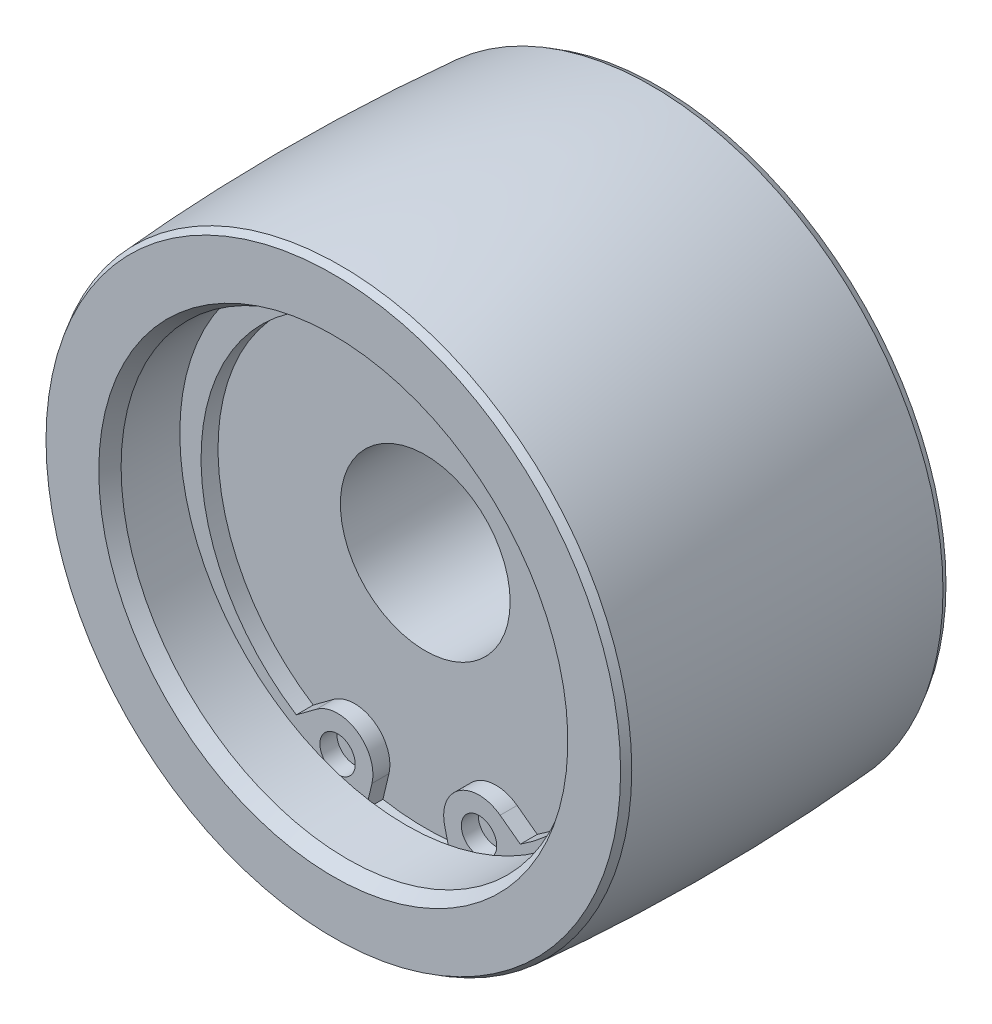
ISO-10303-21;
HEADER;
FILE_DESCRIPTION(('STEP AP214'),'2;1');
FILE_NAME('part.step','',(''),(''),'','','');
FILE_SCHEMA(('AUTOMOTIVE_DESIGN { 1 0 10303 214 1 1 1 1 }'));
ENDSEC;
DATA;
#1=APPLICATION_CONTEXT('core data for automotive mechanical design processes');
#2=APPLICATION_PROTOCOL_DEFINITION('international standard','automotive_design',2000,#1);
#3=PRODUCT_CONTEXT('',#1,'mechanical');
#4=PRODUCT('Part','Part','',(#3));
#5=PRODUCT_RELATED_PRODUCT_CATEGORY('part','',(#4));
#6=PRODUCT_DEFINITION_FORMATION('','',#4);
#7=PRODUCT_DEFINITION_CONTEXT('part definition',#1,'design');
#8=PRODUCT_DEFINITION('design','',#6,#7);
#9=PRODUCT_DEFINITION_SHAPE('','',#8);
#10=(LENGTH_UNIT() NAMED_UNIT(*) SI_UNIT(.MILLI.,.METRE.));
#11=(NAMED_UNIT(*) PLANE_ANGLE_UNIT() SI_UNIT($,.RADIAN.));
#12=(NAMED_UNIT(*) SI_UNIT($,.STERADIAN.) SOLID_ANGLE_UNIT());
#13=UNCERTAINTY_MEASURE_WITH_UNIT(LENGTH_MEASURE(1.E-05),#10,'distance_accuracy_value','');
#14=(GEOMETRIC_REPRESENTATION_CONTEXT(3) GLOBAL_UNCERTAINTY_ASSIGNED_CONTEXT((#13)) GLOBAL_UNIT_ASSIGNED_CONTEXT((#10,
#11,#12)) REPRESENTATION_CONTEXT('',''));
#15=CARTESIAN_POINT('',(0.,0.,0.));
#16=DIRECTION('',(0.,0.,1.));
#17=DIRECTION('',(1.,0.,0.));
#18=AXIS2_PLACEMENT_3D('',#15,#16,#17);
#19=CARTESIAN_POINT('',(0.,0.,0.));
#20=DIRECTION('',(0.,0.,-1.));
#21=DIRECTION('',(-1.,0.,0.));
#22=AXIS2_PLACEMENT_3D('',#19,#20,#21);
#23=DEGENERATE_TOROIDAL_SURFACE('',#22,129.,150.,.F.);
#24=CARTESIAN_POINT('',(0.,0.,-11.));
#25=DIRECTION('',(0.,0.,-1.));
#26=DIRECTION('',(-1.,0.,0.));
#27=AXIS2_PLACEMENT_3D('',#24,#25,#26);
#28=CIRCLE('',#27,20.5961229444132);
#29=CARTESIAN_POINT('',(-20.5961229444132,0.,-11.));
#30=VERTEX_POINT('',#29);
#31=EDGE_CURVE('E185',#30,#30,#28,.F.);
#32=ORIENTED_EDGE('',*,*,#31,.T.);
#33=EDGE_LOOP('',(#32));
#34=FACE_BOUND('',#33,.T.);
#35=CARTESIAN_POINT('',(0.,0.,11.));
#36=DIRECTION('',(0.,0.,1.));
#37=DIRECTION('',(1.,0.,0.));
#38=AXIS2_PLACEMENT_3D('',#35,#36,#37);
#39=CIRCLE('',#38,20.5961229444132);
#40=CARTESIAN_POINT('',(20.5961229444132,0.,11.));
#41=VERTEX_POINT('',#40);
#42=EDGE_CURVE('E171',#41,#41,#39,.F.);
#43=ORIENTED_EDGE('',*,*,#42,.T.);
#44=EDGE_LOOP('',(#43));
#45=FACE_BOUND('',#44,.T.);
#46=ADVANCED_FACE('F14',(#34,#45),#23,.F.);
#47=CARTESIAN_POINT('',(0.,0.,-10.5));
#48=DIRECTION('',(0.,0.,1.));
#49=DIRECTION('',(1.,0.,0.));
#50=AXIS2_PLACEMENT_3D('',#47,#48,#49);
#51=CONICAL_SURFACE('',#50,20.8847980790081,0.523598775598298);
#52=CARTESIAN_POINT('',(0.,0.,-11.5));
#53=DIRECTION('',(0.,0.,-1.));
#54=DIRECTION('',(-1.,0.,0.));
#55=AXIS2_PLACEMENT_3D('',#52,#53,#54);
#56=CIRCLE('',#55,20.3074478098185);
#57=CARTESIAN_POINT('',(-20.3074478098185,0.,-11.5));
#58=VERTEX_POINT('',#57);
#59=EDGE_CURVE('E186',#58,#58,#56,.T.);
#60=ORIENTED_EDGE('',*,*,#59,.F.);
#61=EDGE_LOOP('',(#60));
#62=FACE_BOUND('',#61,.T.);
#63=ORIENTED_EDGE('',*,*,#31,.F.);
#64=EDGE_LOOP('',(#63));
#65=FACE_BOUND('',#64,.T.);
#66=ADVANCED_FACE('F284',(#62,#65),#51,.T.);
#67=CARTESIAN_POINT('',(0.,0.,11.5));
#68=DIRECTION('',(0.,0.,-1.));
#69=DIRECTION('',(-1.,0.,0.));
#70=AXIS2_PLACEMENT_3D('',#67,#68,#69);
#71=CONICAL_SURFACE('',#70,20.3074478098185,0.523598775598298);
#72=CARTESIAN_POINT('',(0.,0.,11.5));
#73=DIRECTION('',(0.,0.,-1.));
#74=DIRECTION('',(-1.,0.,0.));
#75=AXIS2_PLACEMENT_3D('',#72,#73,#74);
#76=CIRCLE('',#75,20.3074478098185);
#77=CARTESIAN_POINT('',(-20.3074478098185,0.,11.5));
#78=VERTEX_POINT('',#77);
#79=EDGE_CURVE('E182',#78,#78,#76,.T.);
#80=ORIENTED_EDGE('',*,*,#79,.T.);
#81=EDGE_LOOP('',(#80));
#82=FACE_BOUND('',#81,.T.);
#83=ORIENTED_EDGE('',*,*,#42,.F.);
#84=EDGE_LOOP('',(#83));
#85=FACE_BOUND('',#84,.T.);
#86=ADVANCED_FACE('F287',(#82,#85),#71,.T.);
#87=CARTESIAN_POINT('',(0.,0.,-11.5));
#88=DIRECTION('',(0.,0.,1.));
#89=DIRECTION('',(1.,0.,0.));
#90=AXIS2_PLACEMENT_3D('',#87,#88,#89);
#91=PLANE('',#90);
#92=ORIENTED_EDGE('',*,*,#59,.T.);
#93=EDGE_LOOP('',(#92));
#94=FACE_BOUND('',#93,.T.);
#95=CARTESIAN_POINT('',(0.,0.,-11.5));
#96=DIRECTION('',(0.,0.,-1.));
#97=DIRECTION('',(-1.,0.,0.));
#98=AXIS2_PLACEMENT_3D('',#95,#96,#97);
#99=CIRCLE('',#98,13.);
#100=CARTESIAN_POINT('',(-13.,0.,-11.5));
#101=VERTEX_POINT('',#100);
#102=EDGE_CURVE('E155',#101,#101,#99,.T.);
#103=ORIENTED_EDGE('',*,*,#102,.F.);
#104=EDGE_LOOP('',(#103));
#105=FACE_BOUND('',#104,.T.);
#106=ADVANCED_FACE('F291',(#94,#105),#91,.F.);
#107=CARTESIAN_POINT('',(0.,0.,11.5));
#108=DIRECTION('',(0.,0.,1.));
#109=DIRECTION('',(1.,0.,0.));
#110=AXIS2_PLACEMENT_3D('',#107,#108,#109);
#111=PLANE('',#110);
#112=ORIENTED_EDGE('',*,*,#79,.F.);
#113=EDGE_LOOP('',(#112));
#114=FACE_BOUND('',#113,.T.);
#115=CARTESIAN_POINT('',(0.,0.,11.5));
#116=DIRECTION('',(0.,0.,-1.));
#117=DIRECTION('',(-1.,0.,0.));
#118=AXIS2_PLACEMENT_3D('',#115,#116,#117);
#119=CIRCLE('',#118,16.5773502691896);
#120=CARTESIAN_POINT('',(-16.5773502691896,0.,11.5));
#121=VERTEX_POINT('',#120);
#122=EDGE_CURVE('E179',#121,#121,#119,.T.);
#123=ORIENTED_EDGE('',*,*,#122,.T.);
#124=EDGE_LOOP('',(#123));
#125=FACE_BOUND('',#124,.T.);
#126=ADVANCED_FACE('F312',(#114,#125),#111,.T.);
#127=CARTESIAN_POINT('',(0.,0.,-12.65));
#128=DIRECTION('',(0.,0.,-1.));
#129=DIRECTION('',(-1.,0.,0.));
#130=AXIS2_PLACEMENT_3D('',#127,#128,#129);
#131=CYLINDRICAL_SURFACE('',#130,13.);
#132=CARTESIAN_POINT('',(0.,0.,-5.));
#133=DIRECTION('',(0.,0.,1.));
#134=DIRECTION('',(1.,0.,0.));
#135=AXIS2_PLACEMENT_3D('',#132,#133,#134);
#136=CIRCLE('',#135,13.);
#137=CARTESIAN_POINT('',(13.,0.,-5.));
#138=VERTEX_POINT('',#137);
#139=EDGE_CURVE('E195',#138,#138,#136,.T.);
#140=ORIENTED_EDGE('',*,*,#139,.T.);
#141=EDGE_LOOP('',(#140));
#142=FACE_BOUND('',#141,.T.);
#143=ORIENTED_EDGE('',*,*,#102,.T.);
#144=EDGE_LOOP('',(#143));
#145=FACE_BOUND('',#144,.T.);
#146=ADVANCED_FACE('F298',(#142,#145),#131,.F.);
#147=CARTESIAN_POINT('',(0.,0.,10.5));
#148=DIRECTION('',(0.,0.,1.));
#149=DIRECTION('',(1.,0.,0.));
#150=AXIS2_PLACEMENT_3D('',#147,#148,#149);
#151=CONICAL_SURFACE('',#150,16.,0.5235987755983);
#152=ORIENTED_EDGE('',*,*,#122,.F.);
#153=EDGE_LOOP('',(#152));
#154=FACE_BOUND('',#153,.T.);
#155=CARTESIAN_POINT('',(0.,0.,10.5));
#156=DIRECTION('',(0.,0.,-1.));
#157=DIRECTION('',(-1.,0.,0.));
#158=AXIS2_PLACEMENT_3D('',#155,#156,#157);
#159=CIRCLE('',#158,16.);
#160=CARTESIAN_POINT('',(-16.,0.,10.5));
#161=VERTEX_POINT('',#160);
#162=EDGE_CURVE('E176',#161,#161,#159,.T.);
#163=ORIENTED_EDGE('',*,*,#162,.T.);
#164=EDGE_LOOP('',(#163));
#165=FACE_BOUND('',#164,.T.);
#166=ADVANCED_FACE('F282',(#154,#165),#151,.F.);
#167=CARTESIAN_POINT('',(0.,6.,-5.));
#168=DIRECTION('',(0.,0.,1.));
#169=DIRECTION('',(1.,0.,0.));
#170=AXIS2_PLACEMENT_3D('',#167,#168,#169);
#171=PLANE('',#170);
#172=ORIENTED_EDGE('',*,*,#139,.F.);
#173=EDGE_LOOP('',(#172));
#174=FACE_BOUND('',#173,.T.);
#175=CARTESIAN_POINT('',(0.,0.,-5.));
#176=DIRECTION('',(0.,0.,1.));
#177=DIRECTION('',(1.,0.,0.));
#178=AXIS2_PLACEMENT_3D('',#175,#176,#177);
#179=CIRCLE('',#178,6.);
#180=CARTESIAN_POINT('',(6.,0.,-5.));
#181=VERTEX_POINT('',#180);
#182=EDGE_CURVE('E189',#181,#181,#179,.T.);
#183=ORIENTED_EDGE('',*,*,#182,.T.);
#184=EDGE_LOOP('',(#183));
#185=FACE_BOUND('',#184,.T.);
#186=ADVANCED_FACE('F279',(#174,#185),#171,.F.);
#187=CARTESIAN_POINT('',(0.,0.,-12.65));
#188=DIRECTION('',(0.,0.,-1.));
#189=DIRECTION('',(-1.,0.,0.));
#190=AXIS2_PLACEMENT_3D('',#187,#188,#189);
#191=CYLINDRICAL_SURFACE('',#190,16.);
#192=ORIENTED_EDGE('',*,*,#162,.F.);
#193=EDGE_LOOP('',(#192));
#194=FACE_BOUND('',#193,.T.);
#195=CARTESIAN_POINT('',(0.,0.,6.35));
#196=DIRECTION('',(0.,0.,-1.));
#197=DIRECTION('',(-1.,0.,0.));
#198=AXIS2_PLACEMENT_3D('',#195,#196,#197);
#199=CIRCLE('',#198,16.);
#200=CARTESIAN_POINT('',(-16.,0.,6.35));
#201=VERTEX_POINT('',#200);
#202=EDGE_CURVE('E168',#201,#201,#199,.T.);
#203=ORIENTED_EDGE('',*,*,#202,.T.);
#204=EDGE_LOOP('',(#203));
#205=FACE_BOUND('',#204,.T.);
#206=ADVANCED_FACE('F277',(#194,#205),#191,.F.);
#207=CARTESIAN_POINT('',(0.,0.,-45.));
#208=DIRECTION('',(0.,0.,1.));
#209=DIRECTION('',(1.,0.,0.));
#210=AXIS2_PLACEMENT_3D('',#207,#208,#209);
#211=CYLINDRICAL_SURFACE('',#210,6.);
#212=ORIENTED_EDGE('',*,*,#182,.F.);
#213=EDGE_LOOP('',(#212));
#214=FACE_BOUND('',#213,.T.);
#215=CARTESIAN_POINT('',(0.,0.,5.));
#216=DIRECTION('',(0.,0.,1.));
#217=DIRECTION('',(1.,0.,0.));
#218=AXIS2_PLACEMENT_3D('',#215,#216,#217);
#219=CIRCLE('',#218,6.);
#220=CARTESIAN_POINT('',(6.,0.,5.));
#221=VERTEX_POINT('',#220);
#222=EDGE_CURVE('E192',#221,#221,#219,.T.);
#223=ORIENTED_EDGE('',*,*,#222,.T.);
#224=EDGE_LOOP('',(#223));
#225=FACE_BOUND('',#224,.T.);
#226=ADVANCED_FACE('F272',(#214,#225),#211,.F.);
#227=CARTESIAN_POINT('',(0.,6.,5.));
#228=DIRECTION('',(0.,0.,-1.));
#229=DIRECTION('',(-1.,0.,0.));
#230=AXIS2_PLACEMENT_3D('',#227,#228,#229);
#231=PLANE('',#230);
#232=ORIENTED_EDGE('',*,*,#222,.F.);
#233=EDGE_LOOP('',(#232));
#234=FACE_BOUND('',#233,.T.);
#235=DIRECTION('',(0.231349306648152,-0.972870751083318,0.));
#236=VECTOR('',#235,1.);
#237=CARTESIAN_POINT('',(-2.25152493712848,5.46458588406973,5.));
#238=LINE('',#237,#236);
#239=CARTESIAN_POINT('',(2.56782312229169,-14.8017500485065,5.));
#240=VERTEX_POINT('',#239);
#241=CARTESIAN_POINT('',(2.99125499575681,-16.5823669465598,5.));
#242=VERTEX_POINT('',#241);
#243=EDGE_CURVE('E9',#240,#242,#238,.T.);
#244=ORIENTED_EDGE('',*,*,#243,.F.);
#245=CARTESIAN_POINT('',(5.,-14.2233767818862,5.));
#246=DIRECTION('',(0.,0.,-1.));
#247=DIRECTION('',(-1.,0.,0.));
#248=AXIS2_PLACEMENT_3D('',#245,#246,#247);
#249=CIRCLE('',#248,2.5);
#250=CARTESIAN_POINT('',(6.49138441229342,-12.2169439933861,5.));
#251=VERTEX_POINT('',#250);
#252=EDGE_CURVE('E25',#240,#251,#249,.T.);
#253=ORIENTED_EDGE('',*,*,#252,.T.);
#254=DIRECTION('',(-0.802573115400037,0.596553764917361,0.));
#255=VECTOR('',#254,1.);
#256=CARTESIAN_POINT('',(-6.41174177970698,-2.62603151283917,5.));
#257=LINE('',#256,#255);
#258=CARTESIAN_POINT('',(7.91695293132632,-13.2765711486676,5.));
#259=VERTEX_POINT('',#258);
#260=EDGE_CURVE('E73',#259,#251,#257,.T.);
#261=ORIENTED_EDGE('',*,*,#260,.F.);
#262=CARTESIAN_POINT('',(0.,-0.95,5.));
#263=DIRECTION('',(0.,0.,-1.));
#264=DIRECTION('',(-1.,0.,0.));
#265=AXIS2_PLACEMENT_3D('',#262,#263,#264);
#266=CIRCLE('',#265,14.65);
#267=CARTESIAN_POINT('',(-7.91695293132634,-13.2765711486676,5.));
#268=VERTEX_POINT('',#267);
#269=EDGE_CURVE('E227',#268,#259,#266,.T.);
#270=ORIENTED_EDGE('',*,*,#269,.F.);
#271=DIRECTION('',(-0.802573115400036,-0.596553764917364,0.));
#272=VECTOR('',#271,1.);
#273=CARTESIAN_POINT('',(6.41174177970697,-2.62603151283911,5.));
#274=LINE('',#273,#272);
#275=CARTESIAN_POINT('',(-6.49138441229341,-12.2169439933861,5.));
#276=VERTEX_POINT('',#275);
#277=EDGE_CURVE('E224',#276,#268,#274,.T.);
#278=ORIENTED_EDGE('',*,*,#277,.F.);
#279=CARTESIAN_POINT('',(-5.,-14.2233767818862,5.));
#280=DIRECTION('',(0.,0.,-1.));
#281=DIRECTION('',(-1.,0.,0.));
#282=AXIS2_PLACEMENT_3D('',#279,#280,#281);
#283=CIRCLE('',#282,2.5);
#284=CARTESIAN_POINT('',(-2.56782312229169,-14.8017500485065,5.));
#285=VERTEX_POINT('',#284);
#286=EDGE_CURVE('E217',#276,#285,#283,.T.);
#287=ORIENTED_EDGE('',*,*,#286,.T.);
#288=DIRECTION('',(0.231349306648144,0.97287075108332,0.));
#289=VECTOR('',#288,1.);
#290=CARTESIAN_POINT('',(2.25152493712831,5.46458588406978,5.));
#291=LINE('',#290,#289);
#292=CARTESIAN_POINT('',(-2.9912549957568,-16.5823669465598,5.));
#293=VERTEX_POINT('',#292);
#294=EDGE_CURVE('E221',#293,#285,#291,.T.);
#295=ORIENTED_EDGE('',*,*,#294,.F.);
#296=CARTESIAN_POINT('',(0.,0.,5.));
#297=DIRECTION('',(0.,0.,-1.));
#298=DIRECTION('',(-1.,0.,0.));
#299=AXIS2_PLACEMENT_3D('',#296,#297,#298);
#300=CIRCLE('',#299,16.85);
#301=EDGE_CURVE('E198',#242,#293,#300,.T.);
#302=ORIENTED_EDGE('',*,*,#301,.F.);
#303=EDGE_LOOP('',(#244,#253,#261,#270,#278,#287,#295,#302));
#304=FACE_BOUND('',#303,.T.);
#305=ADVANCED_FACE('F234',(#234,#304),#231,.F.);
#306=CARTESIAN_POINT('',(0.,16.,6.35));
#307=DIRECTION('',(0.,0.,1.));
#308=DIRECTION('',(1.,0.,0.));
#309=AXIS2_PLACEMENT_3D('',#306,#307,#308);
#310=PLANE('',#309);
#311=ORIENTED_EDGE('',*,*,#202,.F.);
#312=EDGE_LOOP('',(#311));
#313=FACE_BOUND('',#312,.T.);
#314=CARTESIAN_POINT('',(0.,0.,6.35));
#315=DIRECTION('',(0.,0.,-1.));
#316=DIRECTION('',(-1.,0.,0.));
#317=AXIS2_PLACEMENT_3D('',#314,#315,#316);
#318=CIRCLE('',#317,16.85);
#319=CARTESIAN_POINT('',(-16.85,0.,6.35));
#320=VERTEX_POINT('',#319);
#321=EDGE_CURVE('E163',#320,#320,#318,.T.);
#322=ORIENTED_EDGE('',*,*,#321,.T.);
#323=EDGE_LOOP('',(#322));
#324=FACE_BOUND('',#323,.T.);
#325=ADVANCED_FACE('F271',(#313,#324),#310,.F.);
#326=CARTESIAN_POINT('',(0.,0.,-12.65));
#327=DIRECTION('',(0.,0.,-1.));
#328=DIRECTION('',(-1.,0.,0.));
#329=AXIS2_PLACEMENT_3D('',#326,#327,#328);
#330=CYLINDRICAL_SURFACE('',#329,16.85);
#331=ORIENTED_EDGE('',*,*,#321,.F.);
#332=EDGE_LOOP('',(#331));
#333=FACE_BOUND('',#332,.T.);
#334=DIRECTION('',(0.,0.,-1.));
#335=VECTOR('',#334,1.);
#336=CARTESIAN_POINT('',(2.99125499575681,-16.5823669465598,-12.65));
#337=LINE('',#336,#335);
#338=CARTESIAN_POINT('',(2.99125499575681,-16.5823669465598,6.2));
#339=VERTEX_POINT('',#338);
#340=EDGE_CURVE('E206',#242,#339,#337,.F.);
#341=ORIENTED_EDGE('',*,*,#340,.F.);
#342=ORIENTED_EDGE('',*,*,#301,.T.);
#343=DIRECTION('',(0.,0.,-1.));
#344=VECTOR('',#343,1.);
#345=CARTESIAN_POINT('',(-2.99125499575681,-16.5823669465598,-12.65));
#346=LINE('',#345,#344);
#347=CARTESIAN_POINT('',(-2.99125499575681,-16.5823669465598,6.2));
#348=VERTEX_POINT('',#347);
#349=EDGE_CURVE('E201',#348,#293,#346,.T.);
#350=ORIENTED_EDGE('',*,*,#349,.F.);
#351=CARTESIAN_POINT('',(0.,0.,6.2));
#352=DIRECTION('',(0.,0.,-1.));
#353=DIRECTION('',(-1.,0.,0.));
#354=AXIS2_PLACEMENT_3D('',#351,#352,#353);
#355=CIRCLE('',#354,16.85);
#356=EDGE_CURVE('E204',#339,#348,#355,.F.);
#357=ORIENTED_EDGE('',*,*,#356,.F.);
#358=EDGE_LOOP('',(#341,#342,#350,#357));
#359=FACE_BOUND('',#358,.T.);
#360=ADVANCED_FACE('F305',(#333,#359),#330,.F.);
#361=CARTESIAN_POINT('',(5.,-14.2233767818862,5.));
#362=DIRECTION('',(0.,0.,-1.));
#363=DIRECTION('',(-1.,0.,0.));
#364=AXIS2_PLACEMENT_3D('',#361,#362,#363);
#365=CIRCLE('',#364,1.25);
#366=CARTESIAN_POINT('',(3.75,-14.2233767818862,5.));
#367=VERTEX_POINT('',#366);
#368=EDGE_CURVE('E209',#367,#367,#365,.T.);
#369=ORIENTED_EDGE('',*,*,#368,.F.);
#370=EDGE_LOOP('',(#369));
#371=FACE_BOUND('',#370,.T.);
#372=ADVANCED_FACE('F274',(#371),#231,.F.);
#373=CARTESIAN_POINT('',(-5.,-14.2233767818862,5.));
#374=DIRECTION('',(0.,0.,-1.));
#375=DIRECTION('',(-1.,0.,0.));
#376=AXIS2_PLACEMENT_3D('',#373,#374,#375);
#377=CIRCLE('',#376,1.25);
#378=CARTESIAN_POINT('',(-6.25,-14.2233767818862,5.));
#379=VERTEX_POINT('',#378);
#380=EDGE_CURVE('E213',#379,#379,#377,.T.);
#381=ORIENTED_EDGE('',*,*,#380,.F.);
#382=EDGE_LOOP('',(#381));
#383=FACE_BOUND('',#382,.T.);
#384=ADVANCED_FACE('F247',(#383),#231,.F.);
#385=CARTESIAN_POINT('',(6.49138441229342,-12.2169439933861,6.2));
#386=DIRECTION('',(-0.596553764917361,-0.802573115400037,0.));
#387=DIRECTION('',(-0.802573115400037,0.596553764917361,0.));
#388=AXIS2_PLACEMENT_3D('',#385,#386,#387);
#389=PLANE('',#388);
#390=ORIENTED_EDGE('',*,*,#260,.T.);
#391=DIRECTION('',(0.,0.,-1.));
#392=VECTOR('',#391,1.);
#393=CARTESIAN_POINT('',(6.49138441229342,-12.2169439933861,6.2));
#394=LINE('',#393,#392);
#395=CARTESIAN_POINT('',(6.49138441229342,-12.2169439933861,6.2));
#396=VERTEX_POINT('',#395);
#397=EDGE_CURVE('E67',#396,#251,#394,.T.);
#398=ORIENTED_EDGE('',*,*,#397,.F.);
#399=DIRECTION('',(-0.802573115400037,0.596553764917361,0.));
#400=VECTOR('',#399,1.);
#401=CARTESIAN_POINT('',(6.49138441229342,-12.2169439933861,6.2));
#402=LINE('',#401,#400);
#403=CARTESIAN_POINT('',(7.91695293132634,-13.2765711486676,6.2));
#404=VERTEX_POINT('',#403);
#405=EDGE_CURVE('E71',#404,#396,#402,.T.);
#406=ORIENTED_EDGE('',*,*,#405,.F.);
#407=DIRECTION('',(0.,0.,-1.));
#408=VECTOR('',#407,1.);
#409=CARTESIAN_POINT('',(7.91695293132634,-13.2765711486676,6.2));
#410=LINE('',#409,#408);
#411=EDGE_CURVE('E123',#404,#259,#410,.T.);
#412=ORIENTED_EDGE('',*,*,#411,.T.);
#413=EDGE_LOOP('',(#390,#398,#406,#412));
#414=FACE_BOUND('',#413,.T.);
#415=ADVANCED_FACE('F69',(#414),#389,.F.);
#416=CARTESIAN_POINT('',(0.,-0.95,6.2));
#417=DIRECTION('',(0.,0.,1.));
#418=DIRECTION('',(-1.,0.,0.));
#419=AXIS2_PLACEMENT_3D('',#416,#417,#418);
#420=CYLINDRICAL_SURFACE('',#419,14.65);
#421=ORIENTED_EDGE('',*,*,#269,.T.);
#422=ORIENTED_EDGE('',*,*,#411,.F.);
#423=CARTESIAN_POINT('',(0.,-0.95,6.2));
#424=DIRECTION('',(0.,0.,-1.));
#425=DIRECTION('',(0.,-1.,0.));
#426=AXIS2_PLACEMENT_3D('',#423,#424,#425);
#427=CIRCLE('',#426,14.65);
#428=CARTESIAN_POINT('',(-7.91695293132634,-13.2765711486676,6.2));
#429=VERTEX_POINT('',#428);
#430=EDGE_CURVE('E86',#429,#404,#427,.T.);
#431=ORIENTED_EDGE('',*,*,#430,.F.);
#432=DIRECTION('',(0.,0.,-1.));
#433=VECTOR('',#432,1.);
#434=CARTESIAN_POINT('',(-7.91695293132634,-13.2765711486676,6.2));
#435=LINE('',#434,#433);
#436=EDGE_CURVE('E125',#429,#268,#435,.T.);
#437=ORIENTED_EDGE('',*,*,#436,.T.);
#438=EDGE_LOOP('',(#421,#422,#431,#437));
#439=FACE_BOUND('',#438,.T.);
#440=ADVANCED_FACE('F237',(#439),#420,.F.);
#441=CARTESIAN_POINT('',(-6.49138441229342,-12.2169439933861,6.2));
#442=DIRECTION('',(0.596553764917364,-0.802573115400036,0.));
#443=DIRECTION('',(0.,0.,-1.));
#444=AXIS2_PLACEMENT_3D('',#441,#442,#443);
#445=PLANE('',#444);
#446=ORIENTED_EDGE('',*,*,#277,.T.);
#447=ORIENTED_EDGE('',*,*,#436,.F.);
#448=DIRECTION('',(-0.802573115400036,-0.596553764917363,0.));
#449=VECTOR('',#448,1.);
#450=CARTESIAN_POINT('',(-6.49138441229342,-12.2169439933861,6.2));
#451=LINE('',#450,#449);
#452=CARTESIAN_POINT('',(-6.49138441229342,-12.2169439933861,6.2));
#453=VERTEX_POINT('',#452);
#454=EDGE_CURVE('E126',#453,#429,#451,.T.);
#455=ORIENTED_EDGE('',*,*,#454,.F.);
#456=DIRECTION('',(0.,0.,-1.));
#457=VECTOR('',#456,1.);
#458=CARTESIAN_POINT('',(-6.49138441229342,-12.2169439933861,6.2));
#459=LINE('',#458,#457);
#460=EDGE_CURVE('E105',#453,#276,#459,.T.);
#461=ORIENTED_EDGE('',*,*,#460,.T.);
#462=EDGE_LOOP('',(#446,#447,#455,#461));
#463=FACE_BOUND('',#462,.T.);
#464=ADVANCED_FACE('F239',(#463),#445,.F.);
#465=CARTESIAN_POINT('',(5.,-14.2233767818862,6.2));
#466=DIRECTION('',(0.,0.,1.));
#467=DIRECTION('',(-1.,0.,0.));
#468=AXIS2_PLACEMENT_3D('',#465,#466,#467);
#469=CYLINDRICAL_SURFACE('',#468,1.25);
#470=ORIENTED_EDGE('',*,*,#368,.T.);
#471=EDGE_LOOP('',(#470));
#472=FACE_BOUND('',#471,.T.);
#473=CARTESIAN_POINT('',(5.,-14.2233767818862,6.2));
#474=DIRECTION('',(0.,0.,1.));
#475=DIRECTION('',(1.,0.,0.));
#476=AXIS2_PLACEMENT_3D('',#473,#474,#475);
#477=CIRCLE('',#476,1.25);
#478=CARTESIAN_POINT('',(6.25,-14.2233767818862,6.2));
#479=VERTEX_POINT('',#478);
#480=EDGE_CURVE('E118',#479,#479,#477,.T.);
#481=ORIENTED_EDGE('',*,*,#480,.T.);
#482=EDGE_LOOP('',(#481));
#483=FACE_BOUND('',#482,.T.);
#484=ADVANCED_FACE('F245',(#472,#483),#469,.F.);
#485=CARTESIAN_POINT('',(-5.,-14.2233767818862,6.2));
#486=DIRECTION('',(0.,0.,1.));
#487=DIRECTION('',(-1.,0.,0.));
#488=AXIS2_PLACEMENT_3D('',#485,#486,#487);
#489=CYLINDRICAL_SURFACE('',#488,1.25);
#490=ORIENTED_EDGE('',*,*,#380,.T.);
#491=EDGE_LOOP('',(#490));
#492=FACE_BOUND('',#491,.T.);
#493=CARTESIAN_POINT('',(-5.,-14.2233767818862,6.2));
#494=DIRECTION('',(0.,0.,-1.));
#495=DIRECTION('',(1.,0.,0.));
#496=AXIS2_PLACEMENT_3D('',#493,#494,#495);
#497=CIRCLE('',#496,1.25);
#498=CARTESIAN_POINT('',(-3.75,-14.2233767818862,6.2));
#499=VERTEX_POINT('',#498);
#500=EDGE_CURVE('E77',#499,#499,#497,.T.);
#501=ORIENTED_EDGE('',*,*,#500,.F.);
#502=EDGE_LOOP('',(#501));
#503=FACE_BOUND('',#502,.T.);
#504=ADVANCED_FACE('F255',(#492,#503),#489,.F.);
#505=CARTESIAN_POINT('',(5.,-14.2233767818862,6.2));
#506=DIRECTION('',(0.,0.,1.));
#507=DIRECTION('',(-1.,0.,0.));
#508=AXIS2_PLACEMENT_3D('',#505,#506,#507);
#509=CYLINDRICAL_SURFACE('',#508,2.5);
#510=ORIENTED_EDGE('',*,*,#252,.F.);
#511=DIRECTION('',(0.,0.,-1.));
#512=VECTOR('',#511,1.);
#513=CARTESIAN_POINT('',(2.5678231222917,-14.8017500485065,6.2));
#514=LINE('',#513,#512);
#515=CARTESIAN_POINT('',(2.5678231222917,-14.8017500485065,6.2));
#516=VERTEX_POINT('',#515);
#517=EDGE_CURVE('E78',#516,#240,#514,.T.);
#518=ORIENTED_EDGE('',*,*,#517,.F.);
#519=CARTESIAN_POINT('',(5.,-14.2233767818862,6.2));
#520=DIRECTION('',(0.,0.,1.));
#521=DIRECTION('',(1.,0.,0.));
#522=AXIS2_PLACEMENT_3D('',#519,#520,#521);
#523=CIRCLE('',#522,2.5);
#524=EDGE_CURVE('E18',#396,#516,#523,.T.);
#525=ORIENTED_EDGE('',*,*,#524,.F.);
#526=ORIENTED_EDGE('',*,*,#397,.T.);
#527=EDGE_LOOP('',(#510,#518,#525,#526));
#528=FACE_BOUND('',#527,.T.);
#529=ADVANCED_FACE('F16',(#528),#509,.T.);
#530=CARTESIAN_POINT('',(-5.,-14.2233767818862,6.2));
#531=DIRECTION('',(0.,0.,1.));
#532=DIRECTION('',(-1.,0.,0.));
#533=AXIS2_PLACEMENT_3D('',#530,#531,#532);
#534=CYLINDRICAL_SURFACE('',#533,2.5);
#535=ORIENTED_EDGE('',*,*,#286,.F.);
#536=ORIENTED_EDGE('',*,*,#460,.F.);
#537=CARTESIAN_POINT('',(-5.,-14.2233767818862,6.2));
#538=DIRECTION('',(0.,0.,1.));
#539=DIRECTION('',(-1.,0.,0.));
#540=AXIS2_PLACEMENT_3D('',#537,#538,#539);
#541=CIRCLE('',#540,2.5);
#542=CARTESIAN_POINT('',(-2.56782312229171,-14.8017500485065,6.2));
#543=VERTEX_POINT('',#542);
#544=EDGE_CURVE('E102',#543,#453,#541,.T.);
#545=ORIENTED_EDGE('',*,*,#544,.F.);
#546=DIRECTION('',(0.,0.,-1.));
#547=VECTOR('',#546,1.);
#548=CARTESIAN_POINT('',(-2.56782312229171,-14.8017500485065,6.2));
#549=LINE('',#548,#547);
#550=EDGE_CURVE('E122',#543,#285,#549,.T.);
#551=ORIENTED_EDGE('',*,*,#550,.T.);
#552=EDGE_LOOP('',(#535,#536,#545,#551));
#553=FACE_BOUND('',#552,.T.);
#554=ADVANCED_FACE('F258',(#553),#534,.T.);
#555=CARTESIAN_POINT('',(0.,-0.95,6.2));
#556=DIRECTION('',(0.,0.,-1.));
#557=DIRECTION('',(0.,-1.,0.));
#558=AXIS2_PLACEMENT_3D('',#555,#556,#557);
#559=PLANE('',#558);
#560=ORIENTED_EDGE('',*,*,#500,.T.);
#561=EDGE_LOOP('',(#560));
#562=FACE_BOUND('',#561,.T.);
#563=ORIENTED_EDGE('',*,*,#480,.F.);
#564=EDGE_LOOP('',(#563));
#565=FACE_BOUND('',#564,.T.);
#566=DIRECTION('',(0.231349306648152,-0.972870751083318,0.));
#567=VECTOR('',#566,1.);
#568=CARTESIAN_POINT('',(2.5678231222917,-14.8017500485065,6.2));
#569=LINE('',#568,#567);
#570=EDGE_CURVE('E92',#516,#339,#569,.T.);
#571=ORIENTED_EDGE('',*,*,#570,.T.);
#572=ORIENTED_EDGE('',*,*,#356,.T.);
#573=DIRECTION('',(0.231349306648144,0.97287075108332,0.));
#574=VECTOR('',#573,1.);
#575=CARTESIAN_POINT('',(-2.56782312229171,-14.8017500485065,6.2));
#576=LINE('',#575,#574);
#577=EDGE_CURVE('E95',#348,#543,#576,.T.);
#578=ORIENTED_EDGE('',*,*,#577,.T.);
#579=ORIENTED_EDGE('',*,*,#544,.T.);
#580=ORIENTED_EDGE('',*,*,#454,.T.);
#581=ORIENTED_EDGE('',*,*,#430,.T.);
#582=ORIENTED_EDGE('',*,*,#405,.T.);
#583=ORIENTED_EDGE('',*,*,#524,.T.);
#584=EDGE_LOOP('',(#571,#572,#578,#579,#580,#581,#582,#583));
#585=FACE_BOUND('',#584,.T.);
#586=ADVANCED_FACE('F83',(#562,#565,#585),#559,.F.);
#587=CARTESIAN_POINT('',(-2.56782312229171,-14.8017500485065,6.2));
#588=DIRECTION('',(-0.97287075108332,0.231349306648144,0.));
#589=DIRECTION('',(0.,0.,1.));
#590=AXIS2_PLACEMENT_3D('',#587,#588,#589);
#591=PLANE('',#590);
#592=ORIENTED_EDGE('',*,*,#577,.F.);
#593=ORIENTED_EDGE('',*,*,#349,.T.);
#594=ORIENTED_EDGE('',*,*,#294,.T.);
#595=ORIENTED_EDGE('',*,*,#550,.F.);
#596=EDGE_LOOP('',(#592,#593,#594,#595));
#597=FACE_BOUND('',#596,.T.);
#598=ADVANCED_FACE('F253',(#597),#591,.F.);
#599=CARTESIAN_POINT('',(2.5678231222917,-14.8017500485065,6.2));
#600=DIRECTION('',(0.972870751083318,0.231349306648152,0.));
#601=DIRECTION('',(0.,0.,-1.));
#602=AXIS2_PLACEMENT_3D('',#599,#600,#601);
#603=PLANE('',#602);
#604=ORIENTED_EDGE('',*,*,#243,.T.);
#605=ORIENTED_EDGE('',*,*,#340,.T.);
#606=ORIENTED_EDGE('',*,*,#570,.F.);
#607=ORIENTED_EDGE('',*,*,#517,.T.);
#608=EDGE_LOOP('',(#604,#605,#606,#607));
#609=FACE_BOUND('',#608,.T.);
#610=ADVANCED_FACE('F250',(#609),#603,.F.);
#611=CLOSED_SHELL('',(#46,#66,#86,#106,#126,#146,#166,#186,#206,#226,#305,#325,#360,#372,#384,
#415,#440,#464,#484,#504,#529,#554,#586,#598,#610));
#612=MANIFOLD_SOLID_BREP('B1',#611);
#613=ADVANCED_BREP_SHAPE_REPRESENTATION('',(#18,#612),#14);
#614=SHAPE_DEFINITION_REPRESENTATION(#9,#613);
ENDSEC;
END-ISO-10303-21;
